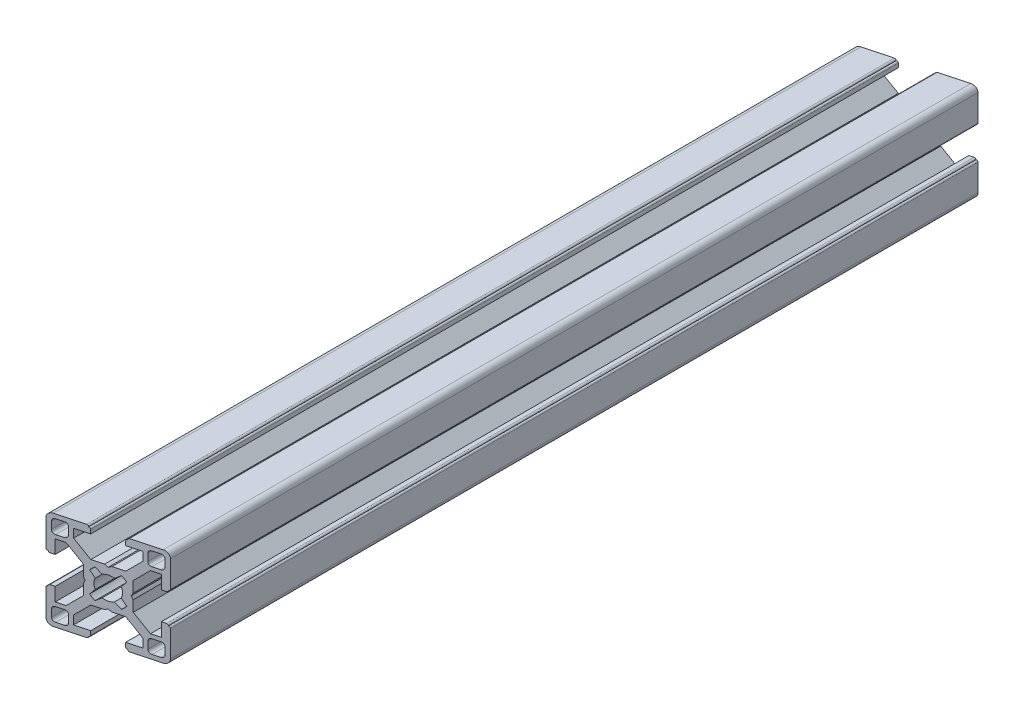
from build123d import *

# Parameters (mm, degrees)
EXTRUSION_3030_DEPTH  = 127
PATTERN_EXTRUDE_COUNT = 4
CUT_EXTRUDE3_DEPTH    = 50.8
CUT_EXTRUDE4_DEPTH    = 50.8


with BuildPart() as part:
    # Sketch1 → Extrusion_3030 (new, symmetric)
    with BuildSketch(Plane.XY):
        with BuildLine():
            Line((-8.325, 12.75), (-4.2, 12.75))
            Line((-4.2, 12.75), (-4.2, 14))
            ThreePointArc((-4.2, 14), (-4.331801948, 14.318198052), (-4.65, 14.45))
            Line((-4.65, 14.45), (-4.7, 14.45))
            Line((-4.7, 14.45), (-4.7, 14.5))
            ThreePointArc((-4.7, 14.5), (-4.831801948, 14.818198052), (-5.15, 14.95))
            Line((-5.15, 14.95), (-13.2, 14.95))
            ThreePointArc((-13.2, 14.95), (-14.437436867, 14.437436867), (-14.95, 13.2))
            Line((-14.95, 13.2), (-14.95, 5.15))
            ThreePointArc((-14.95, 5.15), (-14.818198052, 4.831801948), (-14.5, 4.7))
            Line((-14.5, 4.7), (-14.45, 4.7))
            Line((-14.45, 4.7), (-14.45, 4.65))
            ThreePointArc((-14.45, 4.65), (-14.318198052, 4.331801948), (-14, 4.2))
            Line((-14, 4.2), (-12.75, 4.2))
            Line((-12.75, 4.2), (-12.75, 8.325))
            Line((-12.75, 8.325), (-10.13519336, 8.325))
            Line((-10.13519336, 8.325), (-6, 4.18980664))
            Line((-6, 4.18980664), (-6, 0.875))
            Line((-6, 0.875), (-5.5, 0))
            Line((-5.5, 0), (-3.455011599, 0))
            ThreePointArc((-3.455011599, 0), (-3.369431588, 0.764222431), (-3.116931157, 1.49058556))
            Line((-3.116931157, 1.49058556), (-4.456792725, 3.162787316))
            ThreePointArc((-4.456792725, 3.162787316), (-3.864338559, 3.864338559), (-3.162787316, 4.456792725))
            Line((-3.162787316, 4.456792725), (-1.49058556, 3.116931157))
            ThreePointArc((-1.49058556, 3.116931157), (-0.764222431, 3.369431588), (0, 3.455011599))
            Line((0, 3.455011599), (0, 5.5))
            Line((0, 5.5), (-0.875, 6))
            Line((-0.875, 6), (-4.18980664, 6))
            Line((-4.18980664, 6), (-8.325, 10.13519336))
            Line((-8.325, 10.13519336), (-8.325, 12.75))
        make_face()
        with BuildLine():
            Line((-13.65, 10.5), (-13.65, 12.65))
            ThreePointArc((-13.65, 12.65), (-13.357106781, 13.357106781), (-12.65, 13.65))
            Line((-12.65, 13.65), (-10.5, 13.65))
            ThreePointArc((-10.5, 13.65), (-9.792893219, 13.357106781), (-9.5, 12.65))
            Line((-9.5, 12.65), (-9.5, 10.5))
            ThreePointArc((-9.5, 10.5), (-9.792893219, 9.792893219), (-10.5, 9.5))
            Line((-10.5, 9.5), (-12.65, 9.5))
            ThreePointArc((-12.65, 9.5), (-13.357106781, 9.792893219), (-13.65, 10.5))
        make_face(mode=Mode.SUBTRACT)
    extrusion_3030 = extrude(amount=EXTRUSION_3030_DEPTH, both=True)

    # pattern_extrude: Extrusion_3030 ×4 about axis
    pattern_extrude_axis = Axis((0, 0, 0), (0, 0, 1))
    for i in range(1, PATTERN_EXTRUDE_COUNT):
        add(extrusion_3030.rotate(pattern_extrude_axis, i * 360 / PATTERN_EXTRUDE_COUNT))

    # Sketch9 → Cut-Extrude3 (cut)
    with BuildSketch(Plane(origin=(0, 14.95, 0), x_dir=(1, 0, 0), z_dir=(0, 1, 0))):
        Polygon((-14.95, 127), (14.95, 127), (-14.95, 118.988319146), align=None)
    extrude(amount=-CUT_EXTRUDE3_DEPTH, mode=Mode.SUBTRACT)

    # Sketch11 → Cut-Extrude4 (cut)
    with BuildSketch(Plane(origin=(0, 14.95, 0), x_dir=(1, 0, 0), z_dir=(0, 1, 0))):
        Polygon((-14.95, -127), (14.95, -127), (14.95, -118.988319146), align=None)
    extrude(amount=-CUT_EXTRUDE4_DEPTH, mode=Mode.SUBTRACT)


solid = part.part
